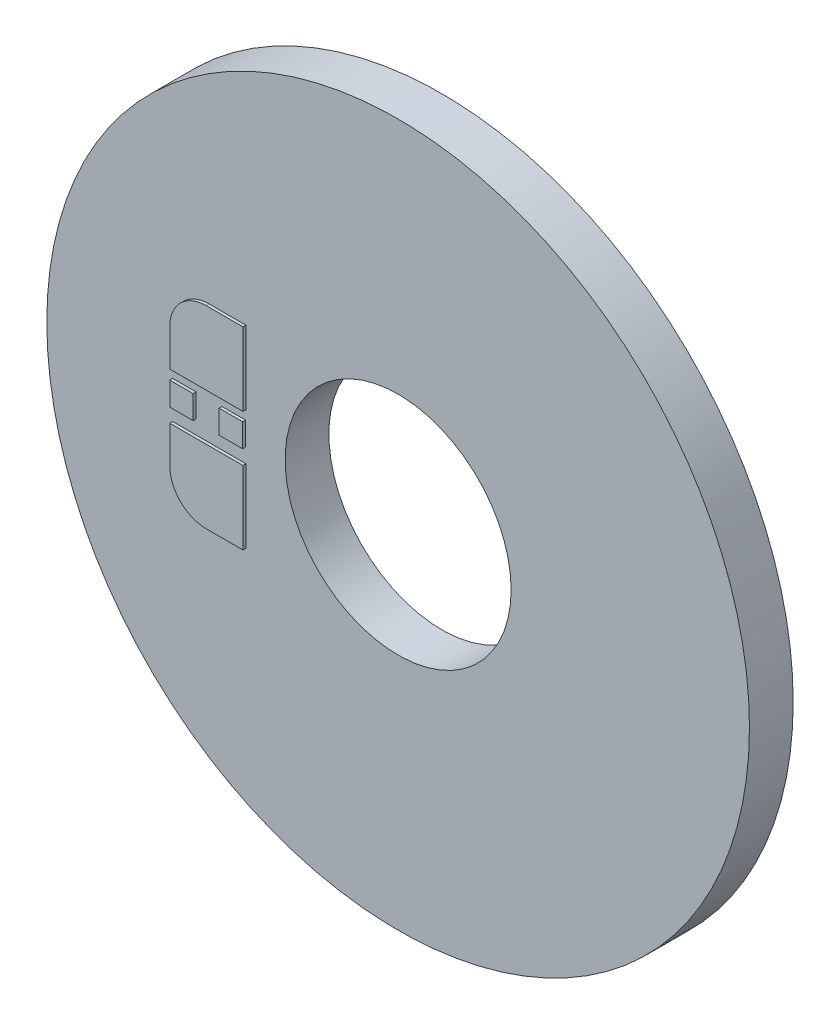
ISO-10303-21;
HEADER;
FILE_DESCRIPTION(('STEP AP214'),'2;1');
FILE_NAME('part.step','',(''),(''),'','','');
FILE_SCHEMA(('AUTOMOTIVE_DESIGN { 1 0 10303 214 1 1 1 1 }'));
ENDSEC;
DATA;
#1=APPLICATION_CONTEXT('core data for automotive mechanical design processes');
#2=APPLICATION_PROTOCOL_DEFINITION('international standard','automotive_design',2000,#1);
#3=PRODUCT_CONTEXT('',#1,'mechanical');
#4=PRODUCT('Part','Part','',(#3));
#5=PRODUCT_RELATED_PRODUCT_CATEGORY('part','',(#4));
#6=PRODUCT_DEFINITION_FORMATION('','',#4);
#7=PRODUCT_DEFINITION_CONTEXT('part definition',#1,'design');
#8=PRODUCT_DEFINITION('design','',#6,#7);
#9=PRODUCT_DEFINITION_SHAPE('','',#8);
#10=(LENGTH_UNIT() NAMED_UNIT(*) SI_UNIT(.MILLI.,.METRE.));
#11=(NAMED_UNIT(*) PLANE_ANGLE_UNIT() SI_UNIT($,.RADIAN.));
#12=(NAMED_UNIT(*) SI_UNIT($,.STERADIAN.) SOLID_ANGLE_UNIT());
#13=UNCERTAINTY_MEASURE_WITH_UNIT(LENGTH_MEASURE(1.E-05),#10,'distance_accuracy_value','');
#14=(GEOMETRIC_REPRESENTATION_CONTEXT(3) GLOBAL_UNCERTAINTY_ASSIGNED_CONTEXT((#13)) GLOBAL_UNIT_ASSIGNED_CONTEXT((#10,
#11,#12)) REPRESENTATION_CONTEXT('',''));
#15=CARTESIAN_POINT('',(0.,0.,0.));
#16=DIRECTION('',(0.,0.,1.));
#17=DIRECTION('',(1.,0.,0.));
#18=AXIS2_PLACEMENT_3D('',#15,#16,#17);
#19=CARTESIAN_POINT('',(0.,0.,1.89738));
#20=DIRECTION('',(0.,0.,1.));
#21=DIRECTION('',(1.,0.,0.));
#22=AXIS2_PLACEMENT_3D('',#19,#20,#21);
#23=PLANE('',#22);
#24=DIRECTION('',(1.,0.,0.));
#25=VECTOR('',#24,1.);
#26=CARTESIAN_POINT('',(-9.779,-0.41261681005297,1.89738));
#27=LINE('',#26,#25);
#28=CARTESIAN_POINT('',(-9.779,-0.41261681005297,1.89738));
#29=VERTEX_POINT('',#28);
#30=CARTESIAN_POINT('',(-8.763,-0.41261681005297,1.89738));
#31=VERTEX_POINT('',#30);
#32=EDGE_CURVE('E199',#29,#31,#27,.T.);
#33=ORIENTED_EDGE('',*,*,#32,.F.);
#34=DIRECTION('',(0.,-1.,0.));
#35=VECTOR('',#34,1.);
#36=CARTESIAN_POINT('',(-9.779,0.60338318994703,1.89738));
#37=LINE('',#36,#35);
#38=CARTESIAN_POINT('',(-9.779,0.60338318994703,1.89738));
#39=VERTEX_POINT('',#38);
#40=EDGE_CURVE('E196',#39,#29,#37,.T.);
#41=ORIENTED_EDGE('',*,*,#40,.F.);
#42=DIRECTION('',(-1.,0.,0.));
#43=VECTOR('',#42,1.);
#44=CARTESIAN_POINT('',(-9.779,0.60338318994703,1.89738));
#45=LINE('',#44,#43);
#46=CARTESIAN_POINT('',(-8.763,0.60338318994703,1.89738));
#47=VERTEX_POINT('',#46);
#48=EDGE_CURVE('E208',#47,#39,#45,.T.);
#49=ORIENTED_EDGE('',*,*,#48,.F.);
#50=DIRECTION('',(0.,1.,0.));
#51=VECTOR('',#50,1.);
#52=CARTESIAN_POINT('',(-8.763,0.60338318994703,1.89738));
#53=LINE('',#52,#51);
#54=EDGE_CURVE('E216',#31,#47,#53,.T.);
#55=ORIENTED_EDGE('',*,*,#54,.F.);
#56=EDGE_LOOP('',(#33,#41,#49,#55));
#57=FACE_BOUND('',#56,.T.);
#58=DIRECTION('',(0.,-1.,0.));
#59=VECTOR('',#58,1.);
#60=CARTESIAN_POINT('',(-6.604,-4.191,1.89738));
#61=LINE('',#60,#59);
#62=CARTESIAN_POINT('',(-6.604,-1.016,1.89738));
#63=VERTEX_POINT('',#62);
#64=CARTESIAN_POINT('',(-6.604,-4.191,1.89738));
#65=VERTEX_POINT('',#64);
#66=EDGE_CURVE('E230',#63,#65,#61,.T.);
#67=ORIENTED_EDGE('',*,*,#66,.T.);
#68=DIRECTION('',(-1.,0.,0.));
#69=VECTOR('',#68,1.);
#70=CARTESIAN_POINT('',(-8.2042,-4.191,1.89738));
#71=LINE('',#70,#69);
#72=CARTESIAN_POINT('',(-8.2042,-4.191,1.89738));
#73=VERTEX_POINT('',#72);
#74=EDGE_CURVE('E235',#65,#73,#71,.T.);
#75=ORIENTED_EDGE('',*,*,#74,.T.);
#76=CARTESIAN_POINT('',(-8.2042,-2.6162,1.89738));
#77=DIRECTION('',(0.,0.,-1.));
#78=DIRECTION('',(-1.,0.,0.));
#79=AXIS2_PLACEMENT_3D('',#76,#77,#78);
#80=CIRCLE('',#79,1.5748);
#81=CARTESIAN_POINT('',(-9.779,-2.6162,1.89738));
#82=VERTEX_POINT('',#81);
#83=EDGE_CURVE('E253',#73,#82,#80,.T.);
#84=ORIENTED_EDGE('',*,*,#83,.T.);
#85=DIRECTION('',(0.,1.,0.));
#86=VECTOR('',#85,1.);
#87=CARTESIAN_POINT('',(-9.779,-2.6162,1.89738));
#88=LINE('',#87,#86);
#89=CARTESIAN_POINT('',(-9.779,-1.016,1.89738));
#90=VERTEX_POINT('',#89);
#91=EDGE_CURVE('E251',#82,#90,#88,.T.);
#92=ORIENTED_EDGE('',*,*,#91,.T.);
#93=DIRECTION('',(1.,0.,0.));
#94=VECTOR('',#93,1.);
#95=CARTESIAN_POINT('',(-9.779,-1.016,1.89738));
#96=LINE('',#95,#94);
#97=EDGE_CURVE('E249',#90,#63,#96,.T.);
#98=ORIENTED_EDGE('',*,*,#97,.T.);
#99=EDGE_LOOP('',(#67,#75,#84,#92,#98));
#100=FACE_BOUND('',#99,.T.);
#101=DIRECTION('',(-1.,0.,0.));
#102=VECTOR('',#101,1.);
#103=CARTESIAN_POINT('',(-8.2042,4.191,1.89738));
#104=LINE('',#103,#102);
#105=CARTESIAN_POINT('',(-6.604,4.191,1.89738));
#106=VERTEX_POINT('',#105);
#107=CARTESIAN_POINT('',(-8.2042,4.191,1.89738));
#108=VERTEX_POINT('',#107);
#109=EDGE_CURVE('E286',#106,#108,#104,.T.);
#110=ORIENTED_EDGE('',*,*,#109,.F.);
#111=DIRECTION('',(0.,1.,0.));
#112=VECTOR('',#111,1.);
#113=CARTESIAN_POINT('',(-6.604,4.191,1.89738));
#114=LINE('',#113,#112);
#115=CARTESIAN_POINT('',(-6.604,1.016,1.89738));
#116=VERTEX_POINT('',#115);
#117=EDGE_CURVE('E270',#116,#106,#114,.T.);
#118=ORIENTED_EDGE('',*,*,#117,.F.);
#119=DIRECTION('',(1.,0.,0.));
#120=VECTOR('',#119,1.);
#121=CARTESIAN_POINT('',(-9.779,1.016,1.89738));
#122=LINE('',#121,#120);
#123=CARTESIAN_POINT('',(-9.779,1.016,1.89738));
#124=VERTEX_POINT('',#123);
#125=EDGE_CURVE('E275',#124,#116,#122,.T.);
#126=ORIENTED_EDGE('',*,*,#125,.F.);
#127=DIRECTION('',(0.,-1.,0.));
#128=VECTOR('',#127,1.);
#129=CARTESIAN_POINT('',(-9.779,2.6162,1.89738));
#130=LINE('',#129,#128);
#131=CARTESIAN_POINT('',(-9.779,2.6162,1.89738));
#132=VERTEX_POINT('',#131);
#133=EDGE_CURVE('E290',#132,#124,#130,.T.);
#134=ORIENTED_EDGE('',*,*,#133,.F.);
#135=CARTESIAN_POINT('',(-8.2042,2.6162,1.89738));
#136=DIRECTION('',(0.,0.,1.));
#137=DIRECTION('',(-1.,0.,0.));
#138=AXIS2_PLACEMENT_3D('',#135,#136,#137);
#139=CIRCLE('',#138,1.5748);
#140=EDGE_CURVE('E288',#108,#132,#139,.T.);
#141=ORIENTED_EDGE('',*,*,#140,.F.);
#142=EDGE_LOOP('',(#110,#118,#126,#134,#141));
#143=FACE_BOUND('',#142,.T.);
#144=CARTESIAN_POINT('',(0.,0.,1.89738));
#145=DIRECTION('',(0.,0.,1.));
#146=DIRECTION('',(1.,0.,0.));
#147=AXIS2_PLACEMENT_3D('',#144,#145,#146);
#148=CIRCLE('',#147,4.9022);
#149=CARTESIAN_POINT('',(4.9022,0.,1.89738));
#150=VERTEX_POINT('',#149);
#151=EDGE_CURVE('E227',#150,#150,#148,.T.);
#152=ORIENTED_EDGE('',*,*,#151,.F.);
#153=EDGE_LOOP('',(#152));
#154=FACE_BOUND('',#153,.T.);
#155=CARTESIAN_POINT('',(0.,0.,1.89738));
#156=DIRECTION('',(0.,0.,1.));
#157=DIRECTION('',(1.,0.,0.));
#158=AXIS2_PLACEMENT_3D('',#155,#156,#157);
#159=CIRCLE('',#158,15.24);
#160=CARTESIAN_POINT('',(-15.24,0.,1.89738));
#161=VERTEX_POINT('',#160);
#162=EDGE_CURVE('E14',#161,#161,#159,.T.);
#163=ORIENTED_EDGE('',*,*,#162,.T.);
#164=EDGE_LOOP('',(#163));
#165=FACE_BOUND('',#164,.T.);
#166=DIRECTION('',(-1.,0.,0.));
#167=VECTOR('',#166,1.);
#168=CARTESIAN_POINT('',(-6.62099911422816,0.618546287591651,1.89738));
#169=LINE('',#168,#167);
#170=CARTESIAN_POINT('',(-6.62099911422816,0.618546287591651,1.89738));
#171=VERTEX_POINT('',#170);
#172=CARTESIAN_POINT('',(-7.63699911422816,0.618546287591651,1.89738));
#173=VERTEX_POINT('',#172);
#174=EDGE_CURVE('E586',#171,#173,#169,.T.);
#175=ORIENTED_EDGE('',*,*,#174,.F.);
#176=DIRECTION('',(0.,1.,0.));
#177=VECTOR('',#176,1.);
#178=CARTESIAN_POINT('',(-6.62099911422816,0.618546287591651,1.89738));
#179=LINE('',#178,#177);
#180=CARTESIAN_POINT('',(-6.62099911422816,-0.397453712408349,1.89738));
#181=VERTEX_POINT('',#180);
#182=EDGE_CURVE('E194',#181,#171,#179,.T.);
#183=ORIENTED_EDGE('',*,*,#182,.F.);
#184=DIRECTION('',(1.,0.,0.));
#185=VECTOR('',#184,1.);
#186=CARTESIAN_POINT('',(-6.62099911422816,-0.397453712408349,1.89738));
#187=LINE('',#186,#185);
#188=CARTESIAN_POINT('',(-7.63699911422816,-0.397453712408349,1.89738));
#189=VERTEX_POINT('',#188);
#190=EDGE_CURVE('E190',#189,#181,#187,.T.);
#191=ORIENTED_EDGE('',*,*,#190,.F.);
#192=DIRECTION('',(0.,-1.,0.));
#193=VECTOR('',#192,1.);
#194=CARTESIAN_POINT('',(-7.63699911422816,0.618546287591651,1.89738));
#195=LINE('',#194,#193);
#196=EDGE_CURVE('E583',#173,#189,#195,.T.);
#197=ORIENTED_EDGE('',*,*,#196,.F.);
#198=EDGE_LOOP('',(#175,#183,#191,#197));
#199=FACE_BOUND('',#198,.T.);
#200=ADVANCED_FACE('F43',(#57,#100,#143,#154,#165,#199),#23,.T.);
#201=CARTESIAN_POINT('',(0.,0.,0.));
#202=DIRECTION('',(0.,0.,1.));
#203=DIRECTION('',(1.,0.,0.));
#204=AXIS2_PLACEMENT_3D('',#201,#202,#203);
#205=PLANE('',#204);
#206=CARTESIAN_POINT('',(0.,0.,0.));
#207=DIRECTION('',(0.,0.,1.));
#208=DIRECTION('',(1.,0.,0.));
#209=AXIS2_PLACEMENT_3D('',#206,#207,#208);
#210=CIRCLE('',#209,4.9022);
#211=CARTESIAN_POINT('',(4.9022,0.,0.));
#212=VERTEX_POINT('',#211);
#213=EDGE_CURVE('E47',#212,#212,#210,.T.);
#214=ORIENTED_EDGE('',*,*,#213,.T.);
#215=EDGE_LOOP('',(#214));
#216=FACE_BOUND('',#215,.T.);
#217=CARTESIAN_POINT('',(0.,0.,0.));
#218=DIRECTION('',(0.,0.,1.));
#219=DIRECTION('',(1.,0.,0.));
#220=AXIS2_PLACEMENT_3D('',#217,#218,#219);
#221=CIRCLE('',#220,15.24);
#222=CARTESIAN_POINT('',(-15.24,0.,0.));
#223=VERTEX_POINT('',#222);
#224=EDGE_CURVE('E52',#223,#223,#221,.T.);
#225=ORIENTED_EDGE('',*,*,#224,.F.);
#226=EDGE_LOOP('',(#225));
#227=FACE_BOUND('',#226,.T.);
#228=ADVANCED_FACE('F310',(#216,#227),#205,.F.);
#229=CARTESIAN_POINT('',(0.,0.,1.89738));
#230=DIRECTION('',(0.,0.,-1.));
#231=DIRECTION('',(-1.,0.,0.));
#232=AXIS2_PLACEMENT_3D('',#229,#230,#231);
#233=CYLINDRICAL_SURFACE('',#232,15.24);
#234=CARTESIAN_POINT('',(-15.24,0.,0.));
#235=CARTESIAN_POINT('',(-15.24,0.,0.019764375));
#236=CARTESIAN_POINT('',(-15.24,0.,0.0395287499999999));
#237=CARTESIAN_POINT('',(-15.24,0.,0.0790574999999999));
#238=CARTESIAN_POINT('',(-15.24,0.,0.098821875));
#239=CARTESIAN_POINT('',(-15.24,0.,0.138350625));
#240=CARTESIAN_POINT('',(-15.24,0.,0.158115));
#241=CARTESIAN_POINT('',(-15.24,0.,0.19764375));
#242=CARTESIAN_POINT('',(-15.24,0.,0.217408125));
#243=CARTESIAN_POINT('',(-15.24,0.,0.256936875));
#244=CARTESIAN_POINT('',(-15.24,0.,0.27670125));
#245=CARTESIAN_POINT('',(-15.24,0.,0.31623));
#246=CARTESIAN_POINT('',(-15.24,0.,0.335994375));
#247=CARTESIAN_POINT('',(-15.24,0.,0.375523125));
#248=CARTESIAN_POINT('',(-15.24,0.,0.3952875));
#249=CARTESIAN_POINT('',(-15.24,0.,0.43481625));
#250=CARTESIAN_POINT('',(-15.24,0.,0.454580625));
#251=CARTESIAN_POINT('',(-15.24,0.,0.494109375));
#252=CARTESIAN_POINT('',(-15.24,0.,0.51387375));
#253=CARTESIAN_POINT('',(-15.24,0.,0.5534025));
#254=CARTESIAN_POINT('',(-15.24,0.,0.573166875));
#255=CARTESIAN_POINT('',(-15.24,0.,0.612695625));
#256=CARTESIAN_POINT('',(-15.24,0.,0.63246));
#257=CARTESIAN_POINT('',(-15.24,0.,0.67198875));
#258=CARTESIAN_POINT('',(-15.24,0.,0.691753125));
#259=CARTESIAN_POINT('',(-15.24,0.,0.731281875));
#260=CARTESIAN_POINT('',(-15.24,0.,0.75104625));
#261=CARTESIAN_POINT('',(-15.24,0.,0.790575));
#262=CARTESIAN_POINT('',(-15.24,0.,0.810339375));
#263=CARTESIAN_POINT('',(-15.24,0.,0.849868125));
#264=CARTESIAN_POINT('',(-15.24,0.,0.8696325));
#265=CARTESIAN_POINT('',(-15.24,0.,0.90916125));
#266=CARTESIAN_POINT('',(-15.24,0.,0.928925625));
#267=CARTESIAN_POINT('',(-15.24,0.,0.968454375));
#268=CARTESIAN_POINT('',(-15.24,0.,0.98821875));
#269=CARTESIAN_POINT('',(-15.24,0.,1.0277475));
#270=CARTESIAN_POINT('',(-15.24,0.,1.047511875));
#271=CARTESIAN_POINT('',(-15.24,0.,1.087040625));
#272=CARTESIAN_POINT('',(-15.24,0.,1.106805));
#273=CARTESIAN_POINT('',(-15.24,0.,1.14633375));
#274=CARTESIAN_POINT('',(-15.24,0.,1.166098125));
#275=CARTESIAN_POINT('',(-15.24,0.,1.205626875));
#276=CARTESIAN_POINT('',(-15.24,0.,1.22539125));
#277=CARTESIAN_POINT('',(-15.24,0.,1.26492));
#278=CARTESIAN_POINT('',(-15.24,0.,1.284684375));
#279=CARTESIAN_POINT('',(-15.24,0.,1.324213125));
#280=CARTESIAN_POINT('',(-15.24,0.,1.3439775));
#281=CARTESIAN_POINT('',(-15.24,0.,1.38350625));
#282=CARTESIAN_POINT('',(-15.24,0.,1.403270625));
#283=CARTESIAN_POINT('',(-15.24,0.,1.442799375));
#284=CARTESIAN_POINT('',(-15.24,0.,1.46256375));
#285=CARTESIAN_POINT('',(-15.24,0.,1.5020925));
#286=CARTESIAN_POINT('',(-15.24,0.,1.521856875));
#287=CARTESIAN_POINT('',(-15.24,0.,1.561385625));
#288=CARTESIAN_POINT('',(-15.24,0.,1.58115));
#289=CARTESIAN_POINT('',(-15.24,0.,1.62067875));
#290=CARTESIAN_POINT('',(-15.24,0.,1.640443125));
#291=CARTESIAN_POINT('',(-15.24,0.,1.679971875));
#292=CARTESIAN_POINT('',(-15.24,0.,1.69973625));
#293=CARTESIAN_POINT('',(-15.24,0.,1.739265));
#294=CARTESIAN_POINT('',(-15.24,0.,1.759029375));
#295=CARTESIAN_POINT('',(-15.24,0.,1.798558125));
#296=CARTESIAN_POINT('',(-15.24,0.,1.8183225));
#297=CARTESIAN_POINT('',(-15.24,0.,1.85785125));
#298=CARTESIAN_POINT('',(-15.24,0.,1.877615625));
#299=CARTESIAN_POINT('',(-15.24,0.,1.89738));
#300=B_SPLINE_CURVE_WITH_KNOTS('',3,(#234,#235,#236,#237,#238,#239,#240,#241,#242,#243,#244,
#245,#246,#247,#248,#249,#250,#251,#252,#253,#254,#255,#256,#257,#258,#259,#260,#261,#262,#263,
#264,#265,#266,#267,#268,#269,#270,#271,#272,#273,#274,#275,#276,#277,#278,#279,#280,#281,#282,
#283,#284,#285,#286,#287,#288,#289,#290,#291,#292,#293,#294,#295,#296,#297,#298,#299),
.UNSPECIFIED.,.F.,.F.,(4,2,2,2,2,2,2,2,2,2,2,2,2,2,2,2,2,2,2,2,2,2,2,2,2,2,2,2,2,2,2,2,4),(0.,
0.0592931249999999,0.11858625,0.177879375,0.2371725,0.296465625,0.35575875,0.415051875,0.474345,
0.533638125,0.59293125,0.652224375,0.7115175,0.770810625,0.83010375,0.889396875,0.94869,
1.007983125,1.06727625,1.126569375,1.1858625,1.245155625,1.30444875,1.363741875,1.423035,
1.482328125,1.54162125,1.600914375,1.6602075,1.719500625,1.77879375,1.838086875,1.89738),.UNSPECIFIED.);
#301=EDGE_CURVE('BSEAM45',#223,#161,#300,.T.);
#302=ORIENTED_EDGE('',*,*,#224,.T.);
#303=ORIENTED_EDGE('',*,*,#162,.F.);
#304=ORIENTED_EDGE('',*,*,#301,.T.);
#305=ORIENTED_EDGE('',*,*,#301,.F.);
#306=EDGE_LOOP('',(#302,#304,#303,#305));
#307=FACE_BOUND('',#306,.T.);
#308=ADVANCED_FACE('F45',(#307),#233,.T.);
#309=CARTESIAN_POINT('',(-6.604,4.191,2.02438));
#310=DIRECTION('',(-1.,0.,0.));
#311=DIRECTION('',(0.,-1.,0.));
#312=AXIS2_PLACEMENT_3D('',#309,#310,#311);
#313=PLANE('',#312);
#314=ORIENTED_EDGE('',*,*,#117,.T.);
#315=DIRECTION('',(0.,0.,-1.));
#316=VECTOR('',#315,1.);
#317=CARTESIAN_POINT('',(-6.604,4.191,2.02438));
#318=LINE('',#317,#316);
#319=CARTESIAN_POINT('',(-6.604,4.191,2.02438));
#320=VERTEX_POINT('',#319);
#321=EDGE_CURVE('E304',#320,#106,#318,.T.);
#322=ORIENTED_EDGE('',*,*,#321,.F.);
#323=DIRECTION('',(0.,1.,0.));
#324=VECTOR('',#323,1.);
#325=CARTESIAN_POINT('',(-6.604,4.191,2.02438));
#326=LINE('',#325,#324);
#327=CARTESIAN_POINT('',(-6.604,1.016,2.02438));
#328=VERTEX_POINT('',#327);
#329=EDGE_CURVE('E271',#328,#320,#326,.T.);
#330=ORIENTED_EDGE('',*,*,#329,.F.);
#331=DIRECTION('',(0.,0.,-1.));
#332=VECTOR('',#331,1.);
#333=CARTESIAN_POINT('',(-6.604,1.016,2.02438));
#334=LINE('',#333,#332);
#335=EDGE_CURVE('E283',#328,#116,#334,.T.);
#336=ORIENTED_EDGE('',*,*,#335,.T.);
#337=EDGE_LOOP('',(#314,#322,#330,#336));
#338=FACE_BOUND('',#337,.T.);
#339=ADVANCED_FACE('F317',(#338),#313,.F.);
#340=CARTESIAN_POINT('',(-8.2042,4.191,2.02438));
#341=DIRECTION('',(0.,-1.,0.));
#342=DIRECTION('',(0.,0.,-1.));
#343=AXIS2_PLACEMENT_3D('',#340,#341,#342);
#344=PLANE('',#343);
#345=ORIENTED_EDGE('',*,*,#109,.T.);
#346=DIRECTION('',(0.,0.,-1.));
#347=VECTOR('',#346,1.);
#348=CARTESIAN_POINT('',(-8.2042,4.191,2.02438));
#349=LINE('',#348,#347);
#350=CARTESIAN_POINT('',(-8.2042,4.191,2.02438));
#351=VERTEX_POINT('',#350);
#352=EDGE_CURVE('E301',#351,#108,#349,.T.);
#353=ORIENTED_EDGE('',*,*,#352,.F.);
#354=DIRECTION('',(-1.,0.,0.));
#355=VECTOR('',#354,1.);
#356=CARTESIAN_POINT('',(-8.2042,4.191,2.02438));
#357=LINE('',#356,#355);
#358=EDGE_CURVE('E274',#320,#351,#357,.T.);
#359=ORIENTED_EDGE('',*,*,#358,.F.);
#360=ORIENTED_EDGE('',*,*,#321,.T.);
#361=EDGE_LOOP('',(#345,#353,#359,#360));
#362=FACE_BOUND('',#361,.T.);
#363=ADVANCED_FACE('F324',(#362),#344,.F.);
#364=CARTESIAN_POINT('',(-8.2042,2.6162,2.02438));
#365=DIRECTION('',(0.,0.,-1.));
#366=DIRECTION('',(-1.,0.,0.));
#367=AXIS2_PLACEMENT_3D('',#364,#365,#366);
#368=CYLINDRICAL_SURFACE('',#367,1.5748);
#369=ORIENTED_EDGE('',*,*,#140,.T.);
#370=DIRECTION('',(0.,0.,-1.));
#371=VECTOR('',#370,1.);
#372=CARTESIAN_POINT('',(-9.779,2.6162,2.02438));
#373=LINE('',#372,#371);
#374=CARTESIAN_POINT('',(-9.779,2.6162,2.02438));
#375=VERTEX_POINT('',#374);
#376=EDGE_CURVE('E298',#375,#132,#373,.T.);
#377=ORIENTED_EDGE('',*,*,#376,.F.);
#378=CARTESIAN_POINT('',(-8.2042,2.6162,2.02438));
#379=DIRECTION('',(0.,0.,1.));
#380=DIRECTION('',(-1.,0.,0.));
#381=AXIS2_PLACEMENT_3D('',#378,#379,#380);
#382=CIRCLE('',#381,1.5748);
#383=EDGE_CURVE('E277',#351,#375,#382,.T.);
#384=ORIENTED_EDGE('',*,*,#383,.F.);
#385=ORIENTED_EDGE('',*,*,#352,.T.);
#386=EDGE_LOOP('',(#369,#377,#384,#385));
#387=FACE_BOUND('',#386,.T.);
#388=ADVANCED_FACE('F328',(#387),#368,.T.);
#389=CARTESIAN_POINT('',(-9.779,2.6162,2.02438));
#390=DIRECTION('',(1.,0.,0.));
#391=DIRECTION('',(0.,1.,0.));
#392=AXIS2_PLACEMENT_3D('',#389,#390,#391);
#393=PLANE('',#392);
#394=ORIENTED_EDGE('',*,*,#133,.T.);
#395=DIRECTION('',(0.,0.,-1.));
#396=VECTOR('',#395,1.);
#397=CARTESIAN_POINT('',(-9.779,1.016,2.02438));
#398=LINE('',#397,#396);
#399=CARTESIAN_POINT('',(-9.779,1.016,2.02438));
#400=VERTEX_POINT('',#399);
#401=EDGE_CURVE('E296',#400,#124,#398,.T.);
#402=ORIENTED_EDGE('',*,*,#401,.F.);
#403=DIRECTION('',(0.,-1.,0.));
#404=VECTOR('',#403,1.);
#405=CARTESIAN_POINT('',(-9.779,2.6162,2.02438));
#406=LINE('',#405,#404);
#407=EDGE_CURVE('E279',#375,#400,#406,.T.);
#408=ORIENTED_EDGE('',*,*,#407,.F.);
#409=ORIENTED_EDGE('',*,*,#376,.T.);
#410=EDGE_LOOP('',(#394,#402,#408,#409));
#411=FACE_BOUND('',#410,.T.);
#412=ADVANCED_FACE('F332',(#411),#393,.F.);
#413=CARTESIAN_POINT('',(-9.779,1.016,2.02438));
#414=DIRECTION('',(0.,1.,0.));
#415=DIRECTION('',(0.,0.,1.));
#416=AXIS2_PLACEMENT_3D('',#413,#414,#415);
#417=PLANE('',#416);
#418=ORIENTED_EDGE('',*,*,#125,.T.);
#419=ORIENTED_EDGE('',*,*,#335,.F.);
#420=DIRECTION('',(1.,0.,0.));
#421=VECTOR('',#420,1.);
#422=CARTESIAN_POINT('',(-9.779,1.016,2.02438));
#423=LINE('',#422,#421);
#424=EDGE_CURVE('E281',#400,#328,#423,.T.);
#425=ORIENTED_EDGE('',*,*,#424,.F.);
#426=ORIENTED_EDGE('',*,*,#401,.T.);
#427=EDGE_LOOP('',(#418,#419,#425,#426));
#428=FACE_BOUND('',#427,.T.);
#429=ADVANCED_FACE('F336',(#428),#417,.F.);
#430=CARTESIAN_POINT('',(-8.2042,2.6162,2.02438));
#431=DIRECTION('',(0.,0.,-1.));
#432=DIRECTION('',(-1.,0.,0.));
#433=AXIS2_PLACEMENT_3D('',#430,#431,#432);
#434=PLANE('',#433);
#435=ORIENTED_EDGE('',*,*,#329,.T.);
#436=ORIENTED_EDGE('',*,*,#358,.T.);
#437=ORIENTED_EDGE('',*,*,#383,.T.);
#438=ORIENTED_EDGE('',*,*,#407,.T.);
#439=ORIENTED_EDGE('',*,*,#424,.T.);
#440=EDGE_LOOP('',(#435,#436,#437,#438,#439));
#441=FACE_BOUND('',#440,.T.);
#442=ADVANCED_FACE('F340',(#441),#434,.F.);
#443=CARTESIAN_POINT('',(-6.604,-4.191,2.02438));
#444=DIRECTION('',(1.,0.,0.));
#445=DIRECTION('',(0.,1.,0.));
#446=AXIS2_PLACEMENT_3D('',#443,#444,#445);
#447=PLANE('',#446);
#448=ORIENTED_EDGE('',*,*,#66,.F.);
#449=DIRECTION('',(0.,0.,-1.));
#450=VECTOR('',#449,1.);
#451=CARTESIAN_POINT('',(-6.604,-1.016,2.02438));
#452=LINE('',#451,#450);
#453=CARTESIAN_POINT('',(-6.604,-1.016,2.02438));
#454=VERTEX_POINT('',#453);
#455=EDGE_CURVE('E267',#454,#63,#452,.T.);
#456=ORIENTED_EDGE('',*,*,#455,.F.);
#457=DIRECTION('',(0.,-1.,0.));
#458=VECTOR('',#457,1.);
#459=CARTESIAN_POINT('',(-6.604,-4.191,2.02438));
#460=LINE('',#459,#458);
#461=CARTESIAN_POINT('',(-6.604,-4.191,2.02438));
#462=VERTEX_POINT('',#461);
#463=EDGE_CURVE('E231',#454,#462,#460,.T.);
#464=ORIENTED_EDGE('',*,*,#463,.T.);
#465=DIRECTION('',(0.,0.,-1.));
#466=VECTOR('',#465,1.);
#467=CARTESIAN_POINT('',(-6.604,-4.191,2.02438));
#468=LINE('',#467,#466);
#469=EDGE_CURVE('E247',#462,#65,#468,.T.);
#470=ORIENTED_EDGE('',*,*,#469,.T.);
#471=EDGE_LOOP('',(#448,#456,#464,#470));
#472=FACE_BOUND('',#471,.T.);
#473=ADVANCED_FACE('F344',(#472),#447,.T.);
#474=CARTESIAN_POINT('',(-9.779,-1.016,2.02438));
#475=DIRECTION('',(0.,1.,0.));
#476=DIRECTION('',(0.,0.,1.));
#477=AXIS2_PLACEMENT_3D('',#474,#475,#476);
#478=PLANE('',#477);
#479=ORIENTED_EDGE('',*,*,#97,.F.);
#480=DIRECTION('',(0.,0.,-1.));
#481=VECTOR('',#480,1.);
#482=CARTESIAN_POINT('',(-9.779,-1.016,2.02438));
#483=LINE('',#482,#481);
#484=CARTESIAN_POINT('',(-9.779,-1.016,2.02438));
#485=VERTEX_POINT('',#484);
#486=EDGE_CURVE('E264',#485,#90,#483,.T.);
#487=ORIENTED_EDGE('',*,*,#486,.F.);
#488=DIRECTION('',(1.,0.,0.));
#489=VECTOR('',#488,1.);
#490=CARTESIAN_POINT('',(-9.779,-1.016,2.02438));
#491=LINE('',#490,#489);
#492=EDGE_CURVE('E234',#485,#454,#491,.T.);
#493=ORIENTED_EDGE('',*,*,#492,.T.);
#494=ORIENTED_EDGE('',*,*,#455,.T.);
#495=EDGE_LOOP('',(#479,#487,#493,#494));
#496=FACE_BOUND('',#495,.T.);
#497=ADVANCED_FACE('F348',(#496),#478,.T.);
#498=CARTESIAN_POINT('',(-9.779,-2.6162,2.02438));
#499=DIRECTION('',(-1.,0.,0.));
#500=DIRECTION('',(0.,-1.,0.));
#501=AXIS2_PLACEMENT_3D('',#498,#499,#500);
#502=PLANE('',#501);
#503=ORIENTED_EDGE('',*,*,#91,.F.);
#504=DIRECTION('',(0.,0.,-1.));
#505=VECTOR('',#504,1.);
#506=CARTESIAN_POINT('',(-9.779,-2.6162,2.02438));
#507=LINE('',#506,#505);
#508=CARTESIAN_POINT('',(-9.779,-2.6162,2.02438));
#509=VERTEX_POINT('',#508);
#510=EDGE_CURVE('E261',#509,#82,#507,.T.);
#511=ORIENTED_EDGE('',*,*,#510,.F.);
#512=DIRECTION('',(0.,1.,0.));
#513=VECTOR('',#512,1.);
#514=CARTESIAN_POINT('',(-9.779,-2.6162,2.02438));
#515=LINE('',#514,#513);
#516=EDGE_CURVE('E238',#509,#485,#515,.T.);
#517=ORIENTED_EDGE('',*,*,#516,.T.);
#518=ORIENTED_EDGE('',*,*,#486,.T.);
#519=EDGE_LOOP('',(#503,#511,#517,#518));
#520=FACE_BOUND('',#519,.T.);
#521=ADVANCED_FACE('F352',(#520),#502,.T.);
#522=CARTESIAN_POINT('',(-8.2042,-2.6162,2.02438));
#523=DIRECTION('',(0.,0.,-1.));
#524=DIRECTION('',(-1.,0.,0.));
#525=AXIS2_PLACEMENT_3D('',#522,#523,#524);
#526=CYLINDRICAL_SURFACE('',#525,1.5748);
#527=ORIENTED_EDGE('',*,*,#83,.F.);
#528=DIRECTION('',(0.,0.,-1.));
#529=VECTOR('',#528,1.);
#530=CARTESIAN_POINT('',(-8.2042,-4.191,2.02438));
#531=LINE('',#530,#529);
#532=CARTESIAN_POINT('',(-8.2042,-4.191,2.02438));
#533=VERTEX_POINT('',#532);
#534=EDGE_CURVE('E258',#533,#73,#531,.T.);
#535=ORIENTED_EDGE('',*,*,#534,.F.);
#536=CARTESIAN_POINT('',(-8.2042,-2.6162,2.02438));
#537=DIRECTION('',(0.,0.,-1.));
#538=DIRECTION('',(-1.,0.,0.));
#539=AXIS2_PLACEMENT_3D('',#536,#537,#538);
#540=CIRCLE('',#539,1.5748);
#541=EDGE_CURVE('E241',#533,#509,#540,.T.);
#542=ORIENTED_EDGE('',*,*,#541,.T.);
#543=ORIENTED_EDGE('',*,*,#510,.T.);
#544=EDGE_LOOP('',(#527,#535,#542,#543));
#545=FACE_BOUND('',#544,.T.);
#546=ADVANCED_FACE('F356',(#545),#526,.T.);
#547=CARTESIAN_POINT('',(-8.2042,-4.191,2.02438));
#548=DIRECTION('',(0.,-1.,0.));
#549=DIRECTION('',(0.,0.,-1.));
#550=AXIS2_PLACEMENT_3D('',#547,#548,#549);
#551=PLANE('',#550);
#552=ORIENTED_EDGE('',*,*,#74,.F.);
#553=ORIENTED_EDGE('',*,*,#469,.F.);
#554=DIRECTION('',(-1.,0.,0.));
#555=VECTOR('',#554,1.);
#556=CARTESIAN_POINT('',(-8.2042,-4.191,2.02438));
#557=LINE('',#556,#555);
#558=EDGE_CURVE('E244',#462,#533,#557,.T.);
#559=ORIENTED_EDGE('',*,*,#558,.T.);
#560=ORIENTED_EDGE('',*,*,#534,.T.);
#561=EDGE_LOOP('',(#552,#553,#559,#560));
#562=FACE_BOUND('',#561,.T.);
#563=ADVANCED_FACE('F360',(#562),#551,.T.);
#564=CARTESIAN_POINT('',(-8.2042,-2.6162,2.02438));
#565=DIRECTION('',(0.,0.,-1.));
#566=DIRECTION('',(-1.,0.,0.));
#567=AXIS2_PLACEMENT_3D('',#564,#565,#566);
#568=PLANE('',#567);
#569=ORIENTED_EDGE('',*,*,#463,.F.);
#570=ORIENTED_EDGE('',*,*,#492,.F.);
#571=ORIENTED_EDGE('',*,*,#516,.F.);
#572=ORIENTED_EDGE('',*,*,#541,.F.);
#573=ORIENTED_EDGE('',*,*,#558,.F.);
#574=EDGE_LOOP('',(#569,#570,#571,#572,#573));
#575=FACE_BOUND('',#574,.T.);
#576=ADVANCED_FACE('F364',(#575),#568,.F.);
#577=CARTESIAN_POINT('',(0.,0.,-0.64262));
#578=DIRECTION('',(0.,0.,1.));
#579=DIRECTION('',(1.,0.,0.));
#580=AXIS2_PLACEMENT_3D('',#577,#578,#579);
#581=CYLINDRICAL_SURFACE('',#580,4.9022);
#582=ORIENTED_EDGE('',*,*,#151,.T.);
#583=EDGE_LOOP('',(#582));
#584=FACE_BOUND('',#583,.T.);
#585=ORIENTED_EDGE('',*,*,#213,.F.);
#586=EDGE_LOOP('',(#585));
#587=FACE_BOUND('',#586,.T.);
#588=ADVANCED_FACE('F368',(#584,#587),#581,.F.);
#589=CARTESIAN_POINT('',(-9.779,0.60338318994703,2.02438));
#590=DIRECTION('',(1.,0.,0.));
#591=DIRECTION('',(0.,0.,-1.));
#592=AXIS2_PLACEMENT_3D('',#589,#590,#591);
#593=PLANE('',#592);
#594=ORIENTED_EDGE('',*,*,#40,.T.);
#595=DIRECTION('',(0.,0.,-1.));
#596=VECTOR('',#595,1.);
#597=CARTESIAN_POINT('',(-9.779,-0.41261681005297,2.02438));
#598=LINE('',#597,#596);
#599=CARTESIAN_POINT('',(-9.779,-0.41261681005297,2.02438));
#600=VERTEX_POINT('',#599);
#601=EDGE_CURVE('E225',#600,#29,#598,.T.);
#602=ORIENTED_EDGE('',*,*,#601,.F.);
#603=DIRECTION('',(0.,-1.,0.));
#604=VECTOR('',#603,1.);
#605=CARTESIAN_POINT('',(-9.779,0.60338318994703,2.02438));
#606=LINE('',#605,#604);
#607=CARTESIAN_POINT('',(-9.779,0.60338318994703,2.02438));
#608=VERTEX_POINT('',#607);
#609=EDGE_CURVE('E204',#608,#600,#606,.T.);
#610=ORIENTED_EDGE('',*,*,#609,.F.);
#611=DIRECTION('',(0.,0.,-1.));
#612=VECTOR('',#611,1.);
#613=CARTESIAN_POINT('',(-9.779,0.60338318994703,2.02438));
#614=LINE('',#613,#612);
#615=EDGE_CURVE('E213',#608,#39,#614,.T.);
#616=ORIENTED_EDGE('',*,*,#615,.T.);
#617=EDGE_LOOP('',(#594,#602,#610,#616));
#618=FACE_BOUND('',#617,.T.);
#619=ADVANCED_FACE('F372',(#618),#593,.F.);
#620=CARTESIAN_POINT('',(-9.779,-0.41261681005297,2.02438));
#621=DIRECTION('',(0.,1.,0.));
#622=DIRECTION('',(0.,0.,1.));
#623=AXIS2_PLACEMENT_3D('',#620,#621,#622);
#624=PLANE('',#623);
#625=ORIENTED_EDGE('',*,*,#32,.T.);
#626=DIRECTION('',(0.,0.,-1.));
#627=VECTOR('',#626,1.);
#628=CARTESIAN_POINT('',(-8.763,-0.41261681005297,2.02438));
#629=LINE('',#628,#627);
#630=CARTESIAN_POINT('',(-8.763,-0.41261681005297,2.02438));
#631=VERTEX_POINT('',#630);
#632=EDGE_CURVE('E222',#631,#31,#629,.T.);
#633=ORIENTED_EDGE('',*,*,#632,.F.);
#634=DIRECTION('',(1.,0.,0.));
#635=VECTOR('',#634,1.);
#636=CARTESIAN_POINT('',(-9.779,-0.41261681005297,2.02438));
#637=LINE('',#636,#635);
#638=EDGE_CURVE('E207',#600,#631,#637,.T.);
#639=ORIENTED_EDGE('',*,*,#638,.F.);
#640=ORIENTED_EDGE('',*,*,#601,.T.);
#641=EDGE_LOOP('',(#625,#633,#639,#640));
#642=FACE_BOUND('',#641,.T.);
#643=ADVANCED_FACE('F376',(#642),#624,.F.);
#644=CARTESIAN_POINT('',(-8.763,0.60338318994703,2.02438));
#645=DIRECTION('',(-1.,0.,0.));
#646=DIRECTION('',(0.,0.,1.));
#647=AXIS2_PLACEMENT_3D('',#644,#645,#646);
#648=PLANE('',#647);
#649=ORIENTED_EDGE('',*,*,#54,.T.);
#650=DIRECTION('',(0.,0.,-1.));
#651=VECTOR('',#650,1.);
#652=CARTESIAN_POINT('',(-8.763,0.60338318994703,2.02438));
#653=LINE('',#652,#651);
#654=CARTESIAN_POINT('',(-8.763,0.60338318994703,2.02438));
#655=VERTEX_POINT('',#654);
#656=EDGE_CURVE('E68',#655,#47,#653,.T.);
#657=ORIENTED_EDGE('',*,*,#656,.F.);
#658=DIRECTION('',(0.,1.,0.));
#659=VECTOR('',#658,1.);
#660=CARTESIAN_POINT('',(-8.763,0.60338318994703,2.02438));
#661=LINE('',#660,#659);
#662=EDGE_CURVE('E210',#631,#655,#661,.T.);
#663=ORIENTED_EDGE('',*,*,#662,.F.);
#664=ORIENTED_EDGE('',*,*,#632,.T.);
#665=EDGE_LOOP('',(#649,#657,#663,#664));
#666=FACE_BOUND('',#665,.T.);
#667=ADVANCED_FACE('F380',(#666),#648,.F.);
#668=CARTESIAN_POINT('',(-9.779,0.60338318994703,2.02438));
#669=DIRECTION('',(0.,-1.,0.));
#670=DIRECTION('',(0.,0.,-1.));
#671=AXIS2_PLACEMENT_3D('',#668,#669,#670);
#672=PLANE('',#671);
#673=ORIENTED_EDGE('',*,*,#48,.T.);
#674=ORIENTED_EDGE('',*,*,#615,.F.);
#675=DIRECTION('',(-1.,0.,0.));
#676=VECTOR('',#675,1.);
#677=CARTESIAN_POINT('',(-9.779,0.60338318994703,2.02438));
#678=LINE('',#677,#676);
#679=EDGE_CURVE('E212',#655,#608,#678,.T.);
#680=ORIENTED_EDGE('',*,*,#679,.F.);
#681=ORIENTED_EDGE('',*,*,#656,.T.);
#682=EDGE_LOOP('',(#673,#674,#680,#681));
#683=FACE_BOUND('',#682,.T.);
#684=ADVANCED_FACE('F384',(#683),#672,.F.);
#685=CARTESIAN_POINT('',(-9.779,-0.41261681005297,2.02438));
#686=DIRECTION('',(0.,0.,1.));
#687=DIRECTION('',(1.,0.,0.));
#688=AXIS2_PLACEMENT_3D('',#685,#686,#687);
#689=PLANE('',#688);
#690=ORIENTED_EDGE('',*,*,#609,.T.);
#691=ORIENTED_EDGE('',*,*,#638,.T.);
#692=ORIENTED_EDGE('',*,*,#662,.T.);
#693=ORIENTED_EDGE('',*,*,#679,.T.);
#694=EDGE_LOOP('',(#690,#691,#692,#693));
#695=FACE_BOUND('',#694,.T.);
#696=ADVANCED_FACE('F388',(#695),#689,.T.);
#697=CARTESIAN_POINT('',(-6.62099911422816,0.618546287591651,2.02438));
#698=DIRECTION('',(-1.,0.,0.));
#699=DIRECTION('',(0.,0.,1.));
#700=AXIS2_PLACEMENT_3D('',#697,#698,#699);
#701=PLANE('',#700);
#702=ORIENTED_EDGE('',*,*,#182,.T.);
#703=DIRECTION('',(0.,0.,-1.));
#704=VECTOR('',#703,1.);
#705=CARTESIAN_POINT('',(-6.62099911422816,0.618546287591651,2.02438));
#706=LINE('',#705,#704);
#707=CARTESIAN_POINT('',(-6.62099911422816,0.618546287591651,2.02438));
#708=VERTEX_POINT('',#707);
#709=EDGE_CURVE('E175',#708,#171,#706,.T.);
#710=ORIENTED_EDGE('',*,*,#709,.F.);
#711=DIRECTION('',(0.,1.,0.));
#712=VECTOR('',#711,1.);
#713=CARTESIAN_POINT('',(-6.62099911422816,0.618546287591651,2.02438));
#714=LINE('',#713,#712);
#715=CARTESIAN_POINT('',(-6.62099911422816,-0.397453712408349,2.02438));
#716=VERTEX_POINT('',#715);
#717=EDGE_CURVE('E182',#716,#708,#714,.T.);
#718=ORIENTED_EDGE('',*,*,#717,.F.);
#719=DIRECTION('',(0.,0.,-1.));
#720=VECTOR('',#719,1.);
#721=CARTESIAN_POINT('',(-6.62099911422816,-0.397453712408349,2.02438));
#722=LINE('',#721,#720);
#723=EDGE_CURVE('E580',#716,#181,#722,.T.);
#724=ORIENTED_EDGE('',*,*,#723,.T.);
#725=EDGE_LOOP('',(#702,#710,#718,#724));
#726=FACE_BOUND('',#725,.T.);
#727=ADVANCED_FACE('F192',(#726),#701,.F.);
#728=CARTESIAN_POINT('',(-6.62099911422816,0.618546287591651,2.02438));
#729=DIRECTION('',(0.,-1.,0.));
#730=DIRECTION('',(1.,0.,0.));
#731=AXIS2_PLACEMENT_3D('',#728,#729,#730);
#732=PLANE('',#731);
#733=ORIENTED_EDGE('',*,*,#174,.T.);
#734=DIRECTION('',(0.,0.,-1.));
#735=VECTOR('',#734,1.);
#736=CARTESIAN_POINT('',(-7.63699911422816,0.618546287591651,2.02438));
#737=LINE('',#736,#735);
#738=CARTESIAN_POINT('',(-7.63699911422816,0.618546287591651,2.02438));
#739=VERTEX_POINT('',#738);
#740=EDGE_CURVE('E178',#739,#173,#737,.T.);
#741=ORIENTED_EDGE('',*,*,#740,.F.);
#742=DIRECTION('',(-1.,0.,0.));
#743=VECTOR('',#742,1.);
#744=CARTESIAN_POINT('',(-6.62099911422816,0.618546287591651,2.02438));
#745=LINE('',#744,#743);
#746=EDGE_CURVE('E171',#708,#739,#745,.T.);
#747=ORIENTED_EDGE('',*,*,#746,.F.);
#748=ORIENTED_EDGE('',*,*,#709,.T.);
#749=EDGE_LOOP('',(#733,#741,#747,#748));
#750=FACE_BOUND('',#749,.T.);
#751=ADVANCED_FACE('F173',(#750),#732,.F.);
#752=CARTESIAN_POINT('',(-7.63699911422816,0.618546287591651,2.02438));
#753=DIRECTION('',(1.,0.,0.));
#754=DIRECTION('',(0.,0.,-1.));
#755=AXIS2_PLACEMENT_3D('',#752,#753,#754);
#756=PLANE('',#755);
#757=ORIENTED_EDGE('',*,*,#196,.T.);
#758=DIRECTION('',(0.,0.,-1.));
#759=VECTOR('',#758,1.);
#760=CARTESIAN_POINT('',(-7.63699911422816,-0.397453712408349,2.02438));
#761=LINE('',#760,#759);
#762=CARTESIAN_POINT('',(-7.63699911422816,-0.397453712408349,2.02438));
#763=VERTEX_POINT('',#762);
#764=EDGE_CURVE('E60',#763,#189,#761,.T.);
#765=ORIENTED_EDGE('',*,*,#764,.F.);
#766=DIRECTION('',(0.,-1.,0.));
#767=VECTOR('',#766,1.);
#768=CARTESIAN_POINT('',(-7.63699911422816,0.618546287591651,2.02438));
#769=LINE('',#768,#767);
#770=EDGE_CURVE('E181',#739,#763,#769,.T.);
#771=ORIENTED_EDGE('',*,*,#770,.F.);
#772=ORIENTED_EDGE('',*,*,#740,.T.);
#773=EDGE_LOOP('',(#757,#765,#771,#772));
#774=FACE_BOUND('',#773,.T.);
#775=ADVANCED_FACE('F396',(#774),#756,.F.);
#776=CARTESIAN_POINT('',(-6.62099911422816,-0.397453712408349,2.02438));
#777=DIRECTION('',(0.,1.,0.));
#778=DIRECTION('',(-1.,0.,0.));
#779=AXIS2_PLACEMENT_3D('',#776,#777,#778);
#780=PLANE('',#779);
#781=ORIENTED_EDGE('',*,*,#190,.T.);
#782=ORIENTED_EDGE('',*,*,#723,.F.);
#783=DIRECTION('',(1.,0.,0.));
#784=VECTOR('',#783,1.);
#785=CARTESIAN_POINT('',(-6.62099911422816,-0.397453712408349,2.02438));
#786=LINE('',#785,#784);
#787=EDGE_CURVE('E186',#763,#716,#786,.T.);
#788=ORIENTED_EDGE('',*,*,#787,.F.);
#789=ORIENTED_EDGE('',*,*,#764,.T.);
#790=EDGE_LOOP('',(#781,#782,#788,#789));
#791=FACE_BOUND('',#790,.T.);
#792=ADVANCED_FACE('F399',(#791),#780,.F.);
#793=CARTESIAN_POINT('',(-6.62099911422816,-0.397453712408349,2.02438));
#794=DIRECTION('',(0.,0.,-1.));
#795=DIRECTION('',(-1.,0.,0.));
#796=AXIS2_PLACEMENT_3D('',#793,#794,#795);
#797=PLANE('',#796);
#798=ORIENTED_EDGE('',*,*,#717,.T.);
#799=ORIENTED_EDGE('',*,*,#746,.T.);
#800=ORIENTED_EDGE('',*,*,#770,.T.);
#801=ORIENTED_EDGE('',*,*,#787,.T.);
#802=EDGE_LOOP('',(#798,#799,#800,#801));
#803=FACE_BOUND('',#802,.T.);
#804=ADVANCED_FACE('F185',(#803),#797,.F.);
#805=CLOSED_SHELL('',(#200,#228,#308,#339,#363,#388,#412,#429,#442,#473,#497,#521,#546,#563,
#576,#588,#619,#643,#667,#684,#696,#727,#751,#775,#792,#804));
#806=MANIFOLD_SOLID_BREP('B2',#805);
#807=ADVANCED_BREP_SHAPE_REPRESENTATION('',(#18,#806),#14);
#808=SHAPE_DEFINITION_REPRESENTATION(#9,#807);
ENDSEC;
END-ISO-10303-21;
